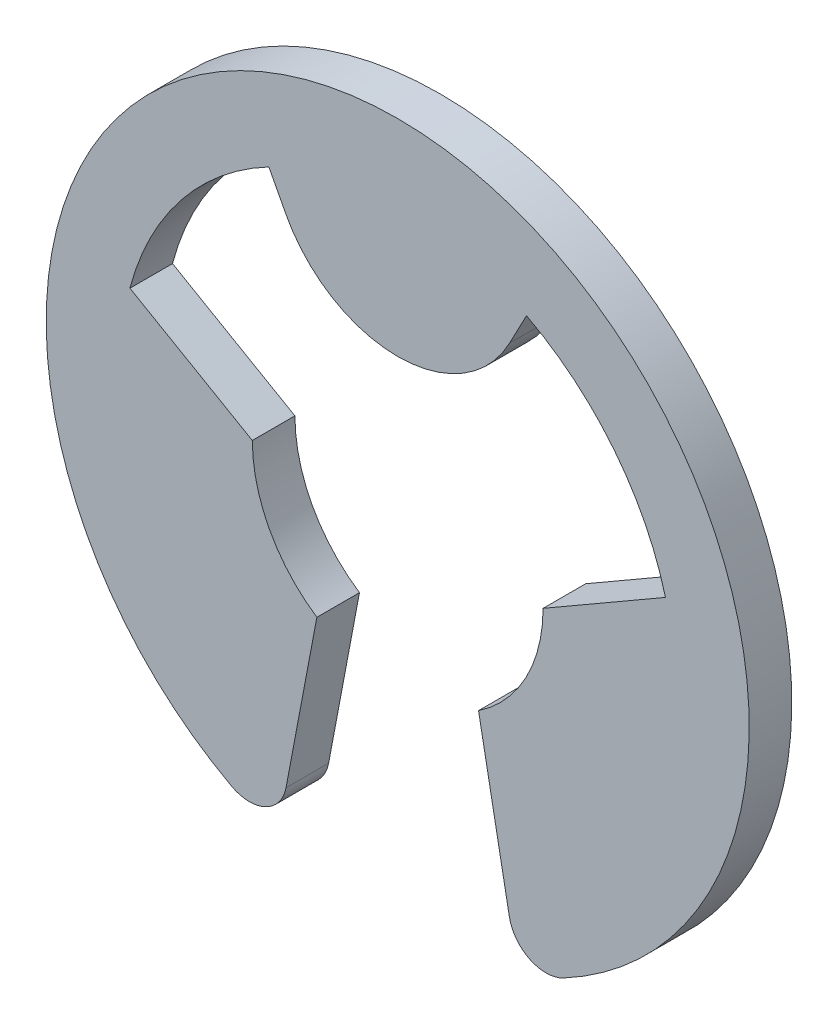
ISO-10303-21;
HEADER;
FILE_DESCRIPTION(('STEP AP214'),'2;1');
FILE_NAME('part.step','',(''),(''),'','','');
FILE_SCHEMA(('AUTOMOTIVE_DESIGN { 1 0 10303 214 1 1 1 1 }'));
ENDSEC;
DATA;
#1=APPLICATION_CONTEXT('core data for automotive mechanical design processes');
#2=APPLICATION_PROTOCOL_DEFINITION('international standard','automotive_design',2000,#1);
#3=PRODUCT_CONTEXT('',#1,'mechanical');
#4=PRODUCT('Part','Part','',(#3));
#5=PRODUCT_RELATED_PRODUCT_CATEGORY('part','',(#4));
#6=PRODUCT_DEFINITION_FORMATION('','',#4);
#7=PRODUCT_DEFINITION_CONTEXT('part definition',#1,'design');
#8=PRODUCT_DEFINITION('design','',#6,#7);
#9=PRODUCT_DEFINITION_SHAPE('','',#8);
#10=(LENGTH_UNIT() NAMED_UNIT(*) SI_UNIT(.MILLI.,.METRE.));
#11=(NAMED_UNIT(*) PLANE_ANGLE_UNIT() SI_UNIT($,.RADIAN.));
#12=(NAMED_UNIT(*) SI_UNIT($,.STERADIAN.) SOLID_ANGLE_UNIT());
#13=UNCERTAINTY_MEASURE_WITH_UNIT(LENGTH_MEASURE(1.E-05),#10,'distance_accuracy_value','');
#14=(GEOMETRIC_REPRESENTATION_CONTEXT(3) GLOBAL_UNCERTAINTY_ASSIGNED_CONTEXT((#13)) GLOBAL_UNIT_ASSIGNED_CONTEXT((#10,
#11,#12)) REPRESENTATION_CONTEXT('',''));
#15=CARTESIAN_POINT('',(0.,0.,0.));
#16=DIRECTION('',(0.,0.,1.));
#17=DIRECTION('',(1.,0.,0.));
#18=AXIS2_PLACEMENT_3D('',#15,#16,#17);
#19=CARTESIAN_POINT('',(0.,0.,0.4));
#20=DIRECTION('',(0.,0.,-1.));
#21=DIRECTION('',(-1.,0.,0.));
#22=AXIS2_PLACEMENT_3D('',#19,#20,#21);
#23=CYLINDRICAL_SURFACE('',#22,2.6);
#24=CARTESIAN_POINT('',(0.,0.,0.));
#25=DIRECTION('',(0.,0.,-1.));
#26=DIRECTION('',(1.,0.,0.));
#27=AXIS2_PLACEMENT_3D('',#24,#25,#26);
#28=CIRCLE('',#27,2.6);
#29=CARTESIAN_POINT('',(1.20930232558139,2.30164894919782,0.));
#30=VERTEX_POINT('',#29);
#31=CARTESIAN_POINT('',(2.51395460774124,0.663349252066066,0.));
#32=VERTEX_POINT('',#31);
#33=EDGE_CURVE('E164',#30,#32,#28,.T.);
#34=ORIENTED_EDGE('',*,*,#33,.T.);
#35=DIRECTION('',(0.,0.,-1.));
#36=VECTOR('',#35,1.);
#37=CARTESIAN_POINT('',(2.51395460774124,0.663349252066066,0.4));
#38=LINE('',#37,#36);
#39=CARTESIAN_POINT('',(2.51395460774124,0.663349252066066,0.4));
#40=VERTEX_POINT('',#39);
#41=EDGE_CURVE('E11',#40,#32,#38,.T.);
#42=ORIENTED_EDGE('',*,*,#41,.F.);
#43=CARTESIAN_POINT('',(0.,0.,0.4));
#44=DIRECTION('',(0.,0.,-1.));
#45=DIRECTION('',(1.,0.,0.));
#46=AXIS2_PLACEMENT_3D('',#43,#44,#45);
#47=CIRCLE('',#46,2.6);
#48=CARTESIAN_POINT('',(1.20930232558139,2.30164894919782,0.4));
#49=VERTEX_POINT('',#48);
#50=EDGE_CURVE('E190',#49,#40,#47,.T.);
#51=ORIENTED_EDGE('',*,*,#50,.F.);
#52=DIRECTION('',(0.,0.,-1.));
#53=VECTOR('',#52,1.);
#54=CARTESIAN_POINT('',(1.20930232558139,2.30164894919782,0.4));
#55=LINE('',#54,#53);
#56=EDGE_CURVE('E160',#49,#30,#55,.T.);
#57=ORIENTED_EDGE('',*,*,#56,.T.);
#58=EDGE_LOOP('',(#34,#42,#51,#57));
#59=FACE_BOUND('',#58,.T.);
#60=ADVANCED_FACE('F32',(#59),#23,.F.);
#61=CARTESIAN_POINT('',(1.365,0.,0.4));
#62=DIRECTION('',(0.500000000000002,-0.866025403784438,0.));
#63=DIRECTION('',(0.866025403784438,0.500000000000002,0.));
#64=AXIS2_PLACEMENT_3D('',#61,#62,#63);
#65=PLANE('',#64);
#66=DIRECTION('',(-0.866025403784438,-0.500000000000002,0.));
#67=VECTOR('',#66,1.);
#68=CARTESIAN_POINT('',(1.365,0.,0.));
#69=LINE('',#68,#67);
#70=CARTESIAN_POINT('',(1.365,0.,0.));
#71=VERTEX_POINT('',#70);
#72=EDGE_CURVE('E167',#32,#71,#69,.T.);
#73=ORIENTED_EDGE('',*,*,#72,.T.);
#74=DIRECTION('',(0.,0.,-1.));
#75=VECTOR('',#74,1.);
#76=CARTESIAN_POINT('',(1.365,0.,0.4));
#77=LINE('',#76,#75);
#78=CARTESIAN_POINT('',(1.365,0.,0.4));
#79=VERTEX_POINT('',#78);
#80=EDGE_CURVE('E40',#79,#71,#77,.T.);
#81=ORIENTED_EDGE('',*,*,#80,.F.);
#82=DIRECTION('',(-0.866025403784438,-0.500000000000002,0.));
#83=VECTOR('',#82,1.);
#84=CARTESIAN_POINT('',(1.365,0.,0.4));
#85=LINE('',#84,#83);
#86=EDGE_CURVE('E109',#40,#79,#85,.T.);
#87=ORIENTED_EDGE('',*,*,#86,.F.);
#88=ORIENTED_EDGE('',*,*,#41,.T.);
#89=EDGE_LOOP('',(#73,#81,#87,#88));
#90=FACE_BOUND('',#89,.T.);
#91=ADVANCED_FACE('F278',(#90),#65,.F.);
#92=CARTESIAN_POINT('',(0.,0.,0.4));
#93=DIRECTION('',(0.,0.,-1.));
#94=DIRECTION('',(-1.,0.,0.));
#95=AXIS2_PLACEMENT_3D('',#92,#93,#94);
#96=CYLINDRICAL_SURFACE('',#95,1.365);
#97=CARTESIAN_POINT('',(0.,0.,0.));
#98=DIRECTION('',(0.,0.,-1.));
#99=DIRECTION('',(1.,0.,0.));
#100=AXIS2_PLACEMENT_3D('',#97,#98,#99);
#101=CIRCLE('',#100,1.365);
#102=CARTESIAN_POINT('',(0.758911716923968,-1.13458274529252,0.));
#103=VERTEX_POINT('',#102);
#104=EDGE_CURVE('E169',#71,#103,#101,.T.);
#105=ORIENTED_EDGE('',*,*,#104,.T.);
#106=DIRECTION('',(0.,0.,-1.));
#107=VECTOR('',#106,1.);
#108=CARTESIAN_POINT('',(0.758911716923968,-1.13458274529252,0.4));
#109=LINE('',#108,#107);
#110=CARTESIAN_POINT('',(0.758911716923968,-1.13458274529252,0.4));
#111=VERTEX_POINT('',#110);
#112=EDGE_CURVE('E215',#111,#103,#109,.T.);
#113=ORIENTED_EDGE('',*,*,#112,.F.);
#114=CARTESIAN_POINT('',(0.,0.,0.4));
#115=DIRECTION('',(0.,0.,-1.));
#116=DIRECTION('',(1.,0.,0.));
#117=AXIS2_PLACEMENT_3D('',#114,#115,#116);
#118=CIRCLE('',#117,1.365);
#119=EDGE_CURVE('E223',#79,#111,#118,.T.);
#120=ORIENTED_EDGE('',*,*,#119,.F.);
#121=ORIENTED_EDGE('',*,*,#80,.T.);
#122=EDGE_LOOP('',(#105,#113,#120,#121));
#123=FACE_BOUND('',#122,.T.);
#124=ADVANCED_FACE('F221',(#123),#96,.F.);
#125=CARTESIAN_POINT('',(0.758911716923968,-1.13458274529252,0.4));
#126=DIRECTION('',(0.982592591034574,0.185773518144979,0.));
#127=DIRECTION('',(-0.185773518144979,0.982592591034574,0.));
#128=AXIS2_PLACEMENT_3D('',#125,#126,#127);
#129=PLANE('',#128);
#130=DIRECTION('',(0.185773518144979,-0.982592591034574,0.));
#131=VECTOR('',#130,1.);
#132=CARTESIAN_POINT('',(0.758911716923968,-1.13458274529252,0.));
#133=LINE('',#132,#131);
#134=CARTESIAN_POINT('',(1.04840737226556,-2.66578207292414,0.));
#135=VERTEX_POINT('',#134);
#136=EDGE_CURVE('E171',#103,#135,#133,.T.);
#137=ORIENTED_EDGE('',*,*,#136,.T.);
#138=DIRECTION('',(0.,0.,-1.));
#139=VECTOR('',#138,1.);
#140=CARTESIAN_POINT('',(1.04840737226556,-2.66578207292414,0.4));
#141=LINE('',#140,#139);
#142=CARTESIAN_POINT('',(1.04840737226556,-2.66578207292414,0.4));
#143=VERTEX_POINT('',#142);
#144=EDGE_CURVE('E212',#143,#135,#141,.T.);
#145=ORIENTED_EDGE('',*,*,#144,.F.);
#146=DIRECTION('',(0.185773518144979,-0.982592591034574,0.));
#147=VECTOR('',#146,1.);
#148=CARTESIAN_POINT('',(0.758911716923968,-1.13458274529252,0.4));
#149=LINE('',#148,#147);
#150=EDGE_CURVE('E241',#111,#143,#149,.T.);
#151=ORIENTED_EDGE('',*,*,#150,.F.);
#152=ORIENTED_EDGE('',*,*,#112,.T.);
#153=EDGE_LOOP('',(#137,#145,#151,#152));
#154=FACE_BOUND('',#153,.T.);
#155=ADVANCED_FACE('F232',(#154),#129,.F.);
#156=CARTESIAN_POINT('',(1.39231477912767,-2.6007613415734,0.4));
#157=DIRECTION('',(0.,0.,-1.));
#158=DIRECTION('',(-1.,0.,0.));
#159=AXIS2_PLACEMENT_3D('',#156,#157,#158);
#160=CYLINDRICAL_SURFACE('',#159,0.350000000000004);
#161=CARTESIAN_POINT('',(1.39231477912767,-2.6007613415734,0.));
#162=DIRECTION('',(0.,0.,1.));
#163=DIRECTION('',(1.,0.,0.));
#164=AXIS2_PLACEMENT_3D('',#161,#162,#163);
#165=CIRCLE('',#164,0.350000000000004);
#166=CARTESIAN_POINT('',(1.55750466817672,-2.90932624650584,0.));
#167=VERTEX_POINT('',#166);
#168=EDGE_CURVE('E173',#135,#167,#165,.T.);
#169=ORIENTED_EDGE('',*,*,#168,.T.);
#170=DIRECTION('',(0.,0.,-1.));
#171=VECTOR('',#170,1.);
#172=CARTESIAN_POINT('',(1.55750466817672,-2.90932624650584,0.4));
#173=LINE('',#172,#171);
#174=CARTESIAN_POINT('',(1.55750466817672,-2.90932624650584,0.4));
#175=VERTEX_POINT('',#174);
#176=EDGE_CURVE('E209',#175,#167,#173,.T.);
#177=ORIENTED_EDGE('',*,*,#176,.F.);
#178=CARTESIAN_POINT('',(1.39231477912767,-2.6007613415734,0.4));
#179=DIRECTION('',(0.,0.,1.));
#180=DIRECTION('',(1.,0.,0.));
#181=AXIS2_PLACEMENT_3D('',#178,#179,#180);
#182=CIRCLE('',#181,0.350000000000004);
#183=EDGE_CURVE('E238',#143,#175,#182,.T.);
#184=ORIENTED_EDGE('',*,*,#183,.F.);
#185=ORIENTED_EDGE('',*,*,#144,.T.);
#186=EDGE_LOOP('',(#169,#177,#184,#185));
#187=FACE_BOUND('',#186,.T.);
#188=ADVANCED_FACE('F236',(#187),#160,.T.);
#189=CARTESIAN_POINT('',(0.,0.,0.4));
#190=DIRECTION('',(0.,0.,-1.));
#191=DIRECTION('',(-1.,0.,0.));
#192=AXIS2_PLACEMENT_3D('',#189,#190,#191);
#193=CYLINDRICAL_SURFACE('',#192,3.3);
#194=CARTESIAN_POINT('',(0.,0.,0.));
#195=DIRECTION('',(0.,0.,1.));
#196=DIRECTION('',(1.,0.,0.));
#197=AXIS2_PLACEMENT_3D('',#194,#195,#196);
#198=CIRCLE('',#197,3.3);
#199=CARTESIAN_POINT('',(-1.55750466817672,-2.90932624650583,0.));
#200=VERTEX_POINT('',#199);
#201=EDGE_CURVE('E175',#167,#200,#198,.T.);
#202=ORIENTED_EDGE('',*,*,#201,.T.);
#203=DIRECTION('',(0.,0.,-1.));
#204=VECTOR('',#203,1.);
#205=CARTESIAN_POINT('',(-1.55750466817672,-2.90932624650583,0.4));
#206=LINE('',#205,#204);
#207=CARTESIAN_POINT('',(-1.55750466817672,-2.90932624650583,0.4));
#208=VERTEX_POINT('',#207);
#209=EDGE_CURVE('E206',#208,#200,#206,.T.);
#210=ORIENTED_EDGE('',*,*,#209,.F.);
#211=CARTESIAN_POINT('',(0.,0.,0.4));
#212=DIRECTION('',(0.,0.,1.));
#213=DIRECTION('',(1.,0.,0.));
#214=AXIS2_PLACEMENT_3D('',#211,#212,#213);
#215=CIRCLE('',#214,3.3);
#216=EDGE_CURVE('E240',#175,#208,#215,.T.);
#217=ORIENTED_EDGE('',*,*,#216,.F.);
#218=ORIENTED_EDGE('',*,*,#176,.T.);
#219=EDGE_LOOP('',(#202,#210,#217,#218));
#220=FACE_BOUND('',#219,.T.);
#221=ADVANCED_FACE('F291',(#220),#193,.T.);
#222=CARTESIAN_POINT('',(-1.39231477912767,-2.6007613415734,0.4));
#223=DIRECTION('',(0.,0.,-1.));
#224=DIRECTION('',(-1.,0.,0.));
#225=AXIS2_PLACEMENT_3D('',#222,#223,#224);
#226=CYLINDRICAL_SURFACE('',#225,0.350000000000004);
#227=CARTESIAN_POINT('',(-1.39231477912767,-2.6007613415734,0.));
#228=DIRECTION('',(0.,0.,1.));
#229=DIRECTION('',(-1.,0.,0.));
#230=AXIS2_PLACEMENT_3D('',#227,#228,#229);
#231=CIRCLE('',#230,0.350000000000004);
#232=CARTESIAN_POINT('',(-1.04840737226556,-2.66578207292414,0.));
#233=VERTEX_POINT('',#232);
#234=EDGE_CURVE('E177',#200,#233,#231,.T.);
#235=ORIENTED_EDGE('',*,*,#234,.T.);
#236=DIRECTION('',(0.,0.,-1.));
#237=VECTOR('',#236,1.);
#238=CARTESIAN_POINT('',(-1.04840737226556,-2.66578207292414,0.4));
#239=LINE('',#238,#237);
#240=CARTESIAN_POINT('',(-1.04840737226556,-2.66578207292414,0.4));
#241=VERTEX_POINT('',#240);
#242=EDGE_CURVE('E203',#241,#233,#239,.T.);
#243=ORIENTED_EDGE('',*,*,#242,.F.);
#244=CARTESIAN_POINT('',(-1.39231477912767,-2.6007613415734,0.4));
#245=DIRECTION('',(0.,0.,1.));
#246=DIRECTION('',(-1.,0.,0.));
#247=AXIS2_PLACEMENT_3D('',#244,#245,#246);
#248=CIRCLE('',#247,0.350000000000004);
#249=EDGE_CURVE('E243',#208,#241,#248,.T.);
#250=ORIENTED_EDGE('',*,*,#249,.F.);
#251=ORIENTED_EDGE('',*,*,#209,.T.);
#252=EDGE_LOOP('',(#235,#243,#250,#251));
#253=FACE_BOUND('',#252,.T.);
#254=ADVANCED_FACE('F294',(#253),#226,.T.);
#255=CARTESIAN_POINT('',(-0.758911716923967,-1.13458274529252,0.4));
#256=DIRECTION('',(-0.982592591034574,0.185773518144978,0.));
#257=DIRECTION('',(-0.185773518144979,-0.982592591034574,0.));
#258=AXIS2_PLACEMENT_3D('',#255,#256,#257);
#259=PLANE('',#258);
#260=DIRECTION('',(0.185773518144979,0.982592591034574,0.));
#261=VECTOR('',#260,1.);
#262=CARTESIAN_POINT('',(-0.758911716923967,-1.13458274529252,0.));
#263=LINE('',#262,#261);
#264=CARTESIAN_POINT('',(-0.758911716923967,-1.13458274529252,0.));
#265=VERTEX_POINT('',#264);
#266=EDGE_CURVE('E179',#233,#265,#263,.T.);
#267=ORIENTED_EDGE('',*,*,#266,.T.);
#268=DIRECTION('',(0.,0.,-1.));
#269=VECTOR('',#268,1.);
#270=CARTESIAN_POINT('',(-0.758911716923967,-1.13458274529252,0.4));
#271=LINE('',#270,#269);
#272=CARTESIAN_POINT('',(-0.758911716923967,-1.13458274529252,0.4));
#273=VERTEX_POINT('',#272);
#274=EDGE_CURVE('E200',#273,#265,#271,.T.);
#275=ORIENTED_EDGE('',*,*,#274,.F.);
#276=DIRECTION('',(0.185773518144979,0.982592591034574,0.));
#277=VECTOR('',#276,1.);
#278=CARTESIAN_POINT('',(-0.758911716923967,-1.13458274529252,0.4));
#279=LINE('',#278,#277);
#280=EDGE_CURVE('E249',#241,#273,#279,.T.);
#281=ORIENTED_EDGE('',*,*,#280,.F.);
#282=ORIENTED_EDGE('',*,*,#242,.T.);
#283=EDGE_LOOP('',(#267,#275,#281,#282));
#284=FACE_BOUND('',#283,.T.);
#285=ADVANCED_FACE('F298',(#284),#259,.F.);
#286=CARTESIAN_POINT('',(0.,0.,0.4));
#287=DIRECTION('',(0.,0.,-1.));
#288=DIRECTION('',(-1.,0.,0.));
#289=AXIS2_PLACEMENT_3D('',#286,#287,#288);
#290=CYLINDRICAL_SURFACE('',#289,1.365);
#291=CARTESIAN_POINT('',(0.,0.,0.));
#292=DIRECTION('',(0.,0.,-1.));
#293=DIRECTION('',(-1.,0.,0.));
#294=AXIS2_PLACEMENT_3D('',#291,#292,#293);
#295=CIRCLE('',#294,1.365);
#296=CARTESIAN_POINT('',(-1.365,0.,0.));
#297=VERTEX_POINT('',#296);
#298=EDGE_CURVE('E181',#265,#297,#295,.T.);
#299=ORIENTED_EDGE('',*,*,#298,.T.);
#300=DIRECTION('',(0.,0.,-1.));
#301=VECTOR('',#300,1.);
#302=CARTESIAN_POINT('',(-1.365,0.,0.4));
#303=LINE('',#302,#301);
#304=CARTESIAN_POINT('',(-1.365,0.,0.4));
#305=VERTEX_POINT('',#304);
#306=EDGE_CURVE('E197',#305,#297,#303,.T.);
#307=ORIENTED_EDGE('',*,*,#306,.F.);
#308=CARTESIAN_POINT('',(0.,0.,0.4));
#309=DIRECTION('',(0.,0.,-1.));
#310=DIRECTION('',(-1.,0.,0.));
#311=AXIS2_PLACEMENT_3D('',#308,#309,#310);
#312=CIRCLE('',#311,1.365);
#313=EDGE_CURVE('E251',#273,#305,#312,.T.);
#314=ORIENTED_EDGE('',*,*,#313,.F.);
#315=ORIENTED_EDGE('',*,*,#274,.T.);
#316=EDGE_LOOP('',(#299,#307,#314,#315));
#317=FACE_BOUND('',#316,.T.);
#318=ADVANCED_FACE('F302',(#317),#290,.F.);
#319=CARTESIAN_POINT('',(-1.365,0.,0.4));
#320=DIRECTION('',(-0.500000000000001,-0.866025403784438,0.));
#321=DIRECTION('',(0.866025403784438,-0.500000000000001,0.));
#322=AXIS2_PLACEMENT_3D('',#319,#320,#321);
#323=PLANE('',#322);
#324=DIRECTION('',(-0.866025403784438,0.500000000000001,0.));
#325=VECTOR('',#324,1.);
#326=CARTESIAN_POINT('',(-1.365,0.,0.));
#327=LINE('',#326,#325);
#328=CARTESIAN_POINT('',(-2.51395460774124,0.663349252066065,0.));
#329=VERTEX_POINT('',#328);
#330=EDGE_CURVE('E183',#297,#329,#327,.T.);
#331=ORIENTED_EDGE('',*,*,#330,.T.);
#332=DIRECTION('',(0.,0.,-1.));
#333=VECTOR('',#332,1.);
#334=CARTESIAN_POINT('',(-2.51395460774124,0.663349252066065,0.4));
#335=LINE('',#334,#333);
#336=CARTESIAN_POINT('',(-2.51395460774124,0.663349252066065,0.4));
#337=VERTEX_POINT('',#336);
#338=EDGE_CURVE('E194',#337,#329,#335,.T.);
#339=ORIENTED_EDGE('',*,*,#338,.F.);
#340=DIRECTION('',(-0.866025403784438,0.500000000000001,0.));
#341=VECTOR('',#340,1.);
#342=CARTESIAN_POINT('',(-1.365,0.,0.4));
#343=LINE('',#342,#341);
#344=EDGE_CURVE('E253',#305,#337,#343,.T.);
#345=ORIENTED_EDGE('',*,*,#344,.F.);
#346=ORIENTED_EDGE('',*,*,#306,.T.);
#347=EDGE_LOOP('',(#331,#339,#345,#346));
#348=FACE_BOUND('',#347,.T.);
#349=ADVANCED_FACE('F259',(#348),#323,.F.);
#350=CARTESIAN_POINT('',(0.,0.,0.4));
#351=DIRECTION('',(0.,0.,-1.));
#352=DIRECTION('',(-1.,0.,0.));
#353=AXIS2_PLACEMENT_3D('',#350,#351,#352);
#354=CYLINDRICAL_SURFACE('',#353,2.6);
#355=CARTESIAN_POINT('',(0.,0.,0.));
#356=DIRECTION('',(0.,0.,-1.));
#357=DIRECTION('',(-1.,0.,0.));
#358=AXIS2_PLACEMENT_3D('',#355,#356,#357);
#359=CIRCLE('',#358,2.6);
#360=CARTESIAN_POINT('',(-1.20930232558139,2.30164894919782,0.));
#361=VERTEX_POINT('',#360);
#362=EDGE_CURVE('E185',#329,#361,#359,.T.);
#363=ORIENTED_EDGE('',*,*,#362,.T.);
#364=DIRECTION('',(0.,0.,-1.));
#365=VECTOR('',#364,1.);
#366=CARTESIAN_POINT('',(-1.20930232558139,2.30164894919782,0.4));
#367=LINE('',#366,#365);
#368=CARTESIAN_POINT('',(-1.20930232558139,2.30164894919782,0.4));
#369=VERTEX_POINT('',#368);
#370=EDGE_CURVE('E155',#369,#361,#367,.T.);
#371=ORIENTED_EDGE('',*,*,#370,.F.);
#372=CARTESIAN_POINT('',(0.,0.,0.4));
#373=DIRECTION('',(0.,0.,-1.));
#374=DIRECTION('',(-1.,0.,0.));
#375=AXIS2_PLACEMENT_3D('',#372,#373,#374);
#376=CIRCLE('',#375,2.6);
#377=EDGE_CURVE('E146',#337,#369,#376,.T.);
#378=ORIENTED_EDGE('',*,*,#377,.F.);
#379=ORIENTED_EDGE('',*,*,#338,.T.);
#380=EDGE_LOOP('',(#363,#371,#378,#379));
#381=FACE_BOUND('',#380,.T.);
#382=ADVANCED_FACE('F263',(#381),#354,.F.);
#383=CARTESIAN_POINT('',(-1.05075278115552,1.99988372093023,0.4));
#384=DIRECTION('',(0.885249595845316,0.465116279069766,0.));
#385=DIRECTION('',(-0.465116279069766,0.885249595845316,0.));
#386=AXIS2_PLACEMENT_3D('',#383,#384,#385);
#387=PLANE('',#386);
#388=DIRECTION('',(0.465116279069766,-0.885249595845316,0.));
#389=VECTOR('',#388,1.);
#390=CARTESIAN_POINT('',(-1.05075278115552,1.99988372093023,0.));
#391=LINE('',#390,#389);
#392=CARTESIAN_POINT('',(-1.05075278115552,1.99988372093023,0.));
#393=VERTEX_POINT('',#392);
#394=EDGE_CURVE('E154',#361,#393,#391,.T.);
#395=ORIENTED_EDGE('',*,*,#394,.T.);
#396=DIRECTION('',(0.,0.,-1.));
#397=VECTOR('',#396,1.);
#398=CARTESIAN_POINT('',(-1.05075278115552,1.99988372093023,0.4));
#399=LINE('',#398,#397);
#400=CARTESIAN_POINT('',(-1.05075278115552,1.99988372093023,0.4));
#401=VERTEX_POINT('',#400);
#402=EDGE_CURVE('E151',#401,#393,#399,.T.);
#403=ORIENTED_EDGE('',*,*,#402,.F.);
#404=DIRECTION('',(0.465116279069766,-0.885249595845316,0.));
#405=VECTOR('',#404,1.);
#406=CARTESIAN_POINT('',(-1.05075278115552,1.99988372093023,0.4));
#407=LINE('',#406,#405);
#408=EDGE_CURVE('E140',#369,#401,#407,.T.);
#409=ORIENTED_EDGE('',*,*,#408,.F.);
#410=ORIENTED_EDGE('',*,*,#370,.T.);
#411=EDGE_LOOP('',(#395,#403,#409,#410));
#412=FACE_BOUND('',#411,.T.);
#413=ADVANCED_FACE('F152',(#412),#387,.F.);
#414=CARTESIAN_POINT('',(0.,2.55195652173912,0.4));
#415=DIRECTION('',(0.,0.,-1.));
#416=DIRECTION('',(-1.,0.,0.));
#417=AXIS2_PLACEMENT_3D('',#414,#415,#416);
#418=CYLINDRICAL_SURFACE('',#417,1.18695652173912);
#419=CARTESIAN_POINT('',(0.,2.55195652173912,0.));
#420=DIRECTION('',(0.,0.,1.));
#421=DIRECTION('',(1.,0.,0.));
#422=AXIS2_PLACEMENT_3D('',#419,#420,#421);
#423=CIRCLE('',#422,1.18695652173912);
#424=CARTESIAN_POINT('',(1.05075278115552,1.99988372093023,0.));
#425=VERTEX_POINT('',#424);
#426=EDGE_CURVE('E95',#393,#425,#423,.T.);
#427=ORIENTED_EDGE('',*,*,#426,.T.);
#428=DIRECTION('',(0.,0.,-1.));
#429=VECTOR('',#428,1.);
#430=CARTESIAN_POINT('',(1.05075278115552,1.99988372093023,0.4));
#431=LINE('',#430,#429);
#432=CARTESIAN_POINT('',(1.05075278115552,1.99988372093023,0.4));
#433=VERTEX_POINT('',#432);
#434=EDGE_CURVE('E156',#433,#425,#431,.T.);
#435=ORIENTED_EDGE('',*,*,#434,.F.);
#436=CARTESIAN_POINT('',(0.,2.55195652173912,0.4));
#437=DIRECTION('',(0.,0.,1.));
#438=DIRECTION('',(1.,0.,0.));
#439=AXIS2_PLACEMENT_3D('',#436,#437,#438);
#440=CIRCLE('',#439,1.18695652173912);
#441=EDGE_CURVE('E144',#401,#433,#440,.T.);
#442=ORIENTED_EDGE('',*,*,#441,.F.);
#443=ORIENTED_EDGE('',*,*,#402,.T.);
#444=EDGE_LOOP('',(#427,#435,#442,#443));
#445=FACE_BOUND('',#444,.T.);
#446=ADVANCED_FACE('F158',(#445),#418,.T.);
#447=CARTESIAN_POINT('',(1.05075278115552,1.99988372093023,0.4));
#448=DIRECTION('',(-0.885249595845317,0.465116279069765,0.));
#449=DIRECTION('',(-0.465116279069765,-0.885249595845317,0.));
#450=AXIS2_PLACEMENT_3D('',#447,#448,#449);
#451=PLANE('',#450);
#452=DIRECTION('',(0.465116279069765,0.885249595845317,0.));
#453=VECTOR('',#452,1.);
#454=CARTESIAN_POINT('',(1.05075278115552,1.99988372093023,0.));
#455=LINE('',#454,#453);
#456=EDGE_CURVE('E101',#425,#30,#455,.T.);
#457=ORIENTED_EDGE('',*,*,#456,.T.);
#458=ORIENTED_EDGE('',*,*,#56,.F.);
#459=DIRECTION('',(0.465116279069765,0.885249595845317,0.));
#460=VECTOR('',#459,1.);
#461=CARTESIAN_POINT('',(1.05075278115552,1.99988372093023,0.4));
#462=LINE('',#461,#460);
#463=EDGE_CURVE('E48',#433,#49,#462,.T.);
#464=ORIENTED_EDGE('',*,*,#463,.F.);
#465=ORIENTED_EDGE('',*,*,#434,.T.);
#466=EDGE_LOOP('',(#457,#458,#464,#465));
#467=FACE_BOUND('',#466,.T.);
#468=ADVANCED_FACE('F267',(#467),#451,.F.);
#469=CARTESIAN_POINT('',(0.,0.,0.4));
#470=DIRECTION('',(0.,0.,1.));
#471=DIRECTION('',(1.,0.,0.));
#472=AXIS2_PLACEMENT_3D('',#469,#470,#471);
#473=PLANE('',#472);
#474=ORIENTED_EDGE('',*,*,#50,.T.);
#475=ORIENTED_EDGE('',*,*,#86,.T.);
#476=ORIENTED_EDGE('',*,*,#119,.T.);
#477=ORIENTED_EDGE('',*,*,#150,.T.);
#478=ORIENTED_EDGE('',*,*,#183,.T.);
#479=ORIENTED_EDGE('',*,*,#216,.T.);
#480=ORIENTED_EDGE('',*,*,#249,.T.);
#481=ORIENTED_EDGE('',*,*,#280,.T.);
#482=ORIENTED_EDGE('',*,*,#313,.T.);
#483=ORIENTED_EDGE('',*,*,#344,.T.);
#484=ORIENTED_EDGE('',*,*,#377,.T.);
#485=ORIENTED_EDGE('',*,*,#408,.T.);
#486=ORIENTED_EDGE('',*,*,#441,.T.);
#487=ORIENTED_EDGE('',*,*,#463,.T.);
#488=EDGE_LOOP('',(#474,#475,#476,#477,#478,#479,#480,#481,#482,#483,#484,#485,#486,#487));
#489=FACE_BOUND('',#488,.T.);
#490=ADVANCED_FACE('F142',(#489),#473,.T.);
#491=CARTESIAN_POINT('',(0.,0.,0.));
#492=DIRECTION('',(0.,0.,1.));
#493=DIRECTION('',(1.,0.,0.));
#494=AXIS2_PLACEMENT_3D('',#491,#492,#493);
#495=PLANE('',#494);
#496=ORIENTED_EDGE('',*,*,#33,.F.);
#497=ORIENTED_EDGE('',*,*,#456,.F.);
#498=ORIENTED_EDGE('',*,*,#426,.F.);
#499=ORIENTED_EDGE('',*,*,#394,.F.);
#500=ORIENTED_EDGE('',*,*,#362,.F.);
#501=ORIENTED_EDGE('',*,*,#330,.F.);
#502=ORIENTED_EDGE('',*,*,#298,.F.);
#503=ORIENTED_EDGE('',*,*,#266,.F.);
#504=ORIENTED_EDGE('',*,*,#234,.F.);
#505=ORIENTED_EDGE('',*,*,#201,.F.);
#506=ORIENTED_EDGE('',*,*,#168,.F.);
#507=ORIENTED_EDGE('',*,*,#136,.F.);
#508=ORIENTED_EDGE('',*,*,#104,.F.);
#509=ORIENTED_EDGE('',*,*,#72,.F.);
#510=EDGE_LOOP('',(#496,#497,#498,#499,#500,#501,#502,#503,#504,#505,#506,#507,#508,#509));
#511=FACE_BOUND('',#510,.T.);
#512=ADVANCED_FACE('F227',(#511),#495,.F.);
#513=CLOSED_SHELL('',(#60,#91,#124,#155,#188,#221,#254,#285,#318,#349,#382,#413,#446,#468,#490,#512));
#514=MANIFOLD_SOLID_BREP('B2',#513);
#515=ADVANCED_BREP_SHAPE_REPRESENTATION('',(#18,#514),#14);
#516=SHAPE_DEFINITION_REPRESENTATION(#9,#515);
ENDSEC;
END-ISO-10303-21;
